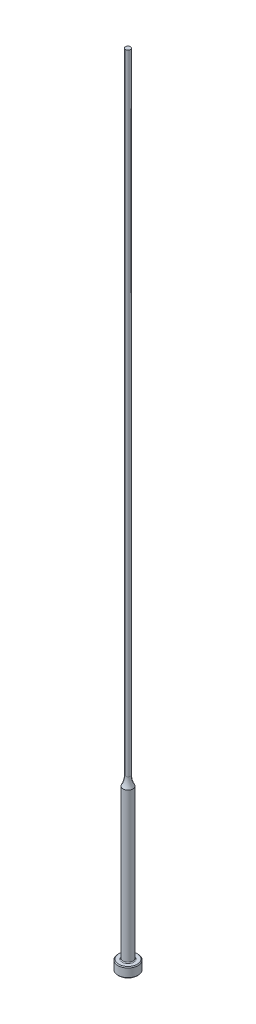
from build123d import *

# Parameters (mm, degrees)
CHAMFER1_SIZE = 0.254
FILLET1_R     = 0.254


with BuildPart() as part:
    # Sketch1 → Revolve1 (revolve)
    with BuildSketch(Plane.XY, mode=Mode.PRIVATE) as revolve1_sk:
        with BuildLine():
            Line((0, 0), (-3.175, 0))
            Line((-3.175, 0), (-3.175, 3.175))
            Line((-3.175, 3.175), (-1.5875, 3.175))
            Line((-1.5875, 3.175), (-1.5875, 50.8))
            ThreePointArc((-1.5875, 50.8), (-0.995388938, 52.286680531), (-0.79375, 53.874180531))
            Line((-0.79375, 53.874180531), (-0.79375, 254))
            Line((-0.79375, 254), (0, 254))
            Line((0, 254), (0, 0))
        make_face()
    revolve(revolve1_sk.sketch.rotate(Axis((0, 259.958771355, 0), (0, -1, 0)), 270), axis=Axis((0, 259.958771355, 0), (0, -1, 0)))

    # Chamfer1
    chamfer1_edges = [part.edges().sort_by_distance(p)[0] for p in [
        (0, 0, -3.175),
        (0, 3.175, -3.175),
    ]]
    chamfer(chamfer1_edges, length=CHAMFER1_SIZE)

    # Fillet1
    fillet1_edges = [part.edges().sort_by_distance(p)[0] for p in [
        (0, 3.175, -1.5875),
    ]]
    fillet(fillet1_edges, radius=FILLET1_R)


solid = part.part
